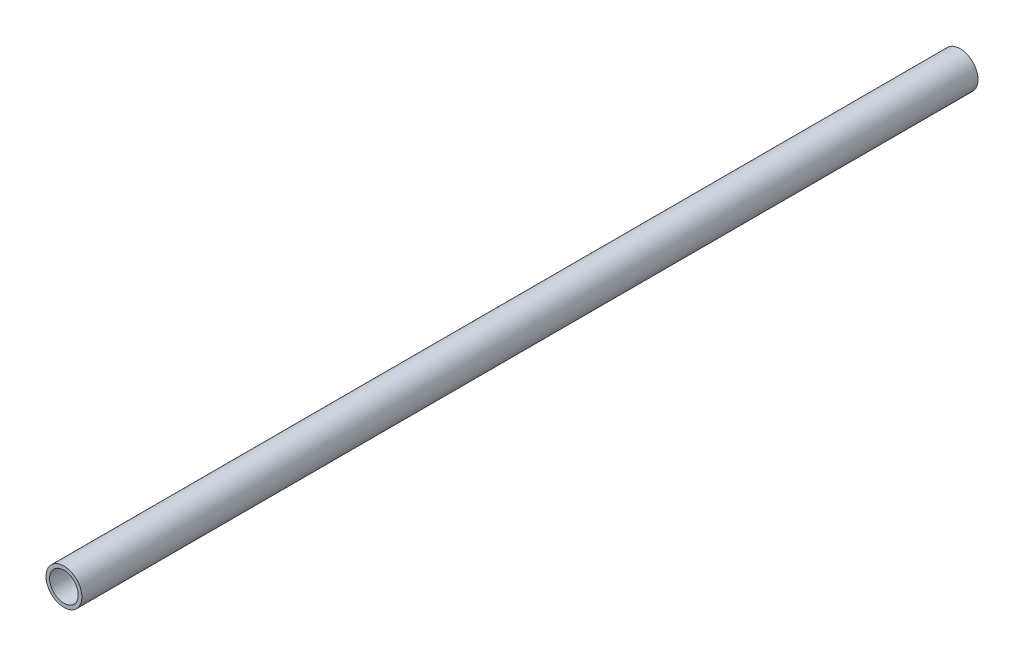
ISO-10303-21;
HEADER;
FILE_DESCRIPTION(('STEP AP214'),'2;1');
FILE_NAME('part.step','',(''),(''),'','','');
FILE_SCHEMA(('AUTOMOTIVE_DESIGN { 1 0 10303 214 1 1 1 1 }'));
ENDSEC;
DATA;
#1=APPLICATION_CONTEXT('core data for automotive mechanical design processes');
#2=APPLICATION_PROTOCOL_DEFINITION('international standard','automotive_design',2000,#1);
#3=PRODUCT_CONTEXT('',#1,'mechanical');
#4=PRODUCT('Part','Part','',(#3));
#5=PRODUCT_RELATED_PRODUCT_CATEGORY('part','',(#4));
#6=PRODUCT_DEFINITION_FORMATION('','',#4);
#7=PRODUCT_DEFINITION_CONTEXT('part definition',#1,'design');
#8=PRODUCT_DEFINITION('design','',#6,#7);
#9=PRODUCT_DEFINITION_SHAPE('','',#8);
#10=(LENGTH_UNIT() NAMED_UNIT(*) SI_UNIT(.MILLI.,.METRE.));
#11=(NAMED_UNIT(*) PLANE_ANGLE_UNIT() SI_UNIT($,.RADIAN.));
#12=(NAMED_UNIT(*) SI_UNIT($,.STERADIAN.) SOLID_ANGLE_UNIT());
#13=UNCERTAINTY_MEASURE_WITH_UNIT(LENGTH_MEASURE(1.E-05),#10,'distance_accuracy_value','');
#14=(GEOMETRIC_REPRESENTATION_CONTEXT(3) GLOBAL_UNCERTAINTY_ASSIGNED_CONTEXT((#13)) GLOBAL_UNIT_ASSIGNED_CONTEXT((#10,
#11,#12)) REPRESENTATION_CONTEXT('',''));
#15=CARTESIAN_POINT('',(0.,0.,0.));
#16=DIRECTION('',(0.,0.,1.));
#17=DIRECTION('',(1.,0.,0.));
#18=AXIS2_PLACEMENT_3D('',#15,#16,#17);
#19=CARTESIAN_POINT('',(0.,0.,635.));
#20=DIRECTION('',(0.,0.,1.));
#21=DIRECTION('',(1.,0.,0.));
#22=AXIS2_PLACEMENT_3D('',#19,#20,#21);
#23=PLANE('',#22);
#24=CARTESIAN_POINT('',(0.,0.,635.));
#25=DIRECTION('',(0.,0.,1.));
#26=DIRECTION('',(1.,0.,0.));
#27=AXIS2_PLACEMENT_3D('',#24,#25,#26);
#28=CIRCLE('',#27,12.7);
#29=CARTESIAN_POINT('',(-12.7,0.,635.));
#30=VERTEX_POINT('',#29);
#31=EDGE_CURVE('E10',#30,#30,#28,.T.);
#32=ORIENTED_EDGE('',*,*,#31,.T.);
#33=EDGE_LOOP('',(#32));
#34=FACE_BOUND('',#33,.T.);
#35=CARTESIAN_POINT('',(0.,0.,635.));
#36=DIRECTION('',(0.,0.,1.));
#37=DIRECTION('',(1.,0.,0.));
#38=AXIS2_PLACEMENT_3D('',#35,#36,#37);
#39=CIRCLE('',#38,10.16);
#40=CARTESIAN_POINT('',(-10.16,0.,635.));
#41=VERTEX_POINT('',#40);
#42=EDGE_CURVE('E41',#41,#41,#39,.T.);
#43=ORIENTED_EDGE('',*,*,#42,.F.);
#44=EDGE_LOOP('',(#43));
#45=FACE_BOUND('',#44,.T.);
#46=ADVANCED_FACE('F30',(#34,#45),#23,.T.);
#47=CARTESIAN_POINT('',(0.,0.,0.));
#48=DIRECTION('',(0.,0.,1.));
#49=DIRECTION('',(1.,0.,0.));
#50=AXIS2_PLACEMENT_3D('',#47,#48,#49);
#51=PLANE('',#50);
#52=CARTESIAN_POINT('',(0.,0.,0.));
#53=DIRECTION('',(0.,0.,1.));
#54=DIRECTION('',(1.,0.,0.));
#55=AXIS2_PLACEMENT_3D('',#52,#53,#54);
#56=CIRCLE('',#55,12.7);
#57=CARTESIAN_POINT('',(-12.7,0.,-1.11022302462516E-13));
#58=VERTEX_POINT('',#57);
#59=EDGE_CURVE('E37',#58,#58,#56,.T.);
#60=ORIENTED_EDGE('',*,*,#59,.F.);
#61=EDGE_LOOP('',(#60));
#62=FACE_BOUND('',#61,.T.);
#63=CARTESIAN_POINT('',(0.,0.,0.));
#64=DIRECTION('',(0.,0.,1.));
#65=DIRECTION('',(1.,0.,0.));
#66=AXIS2_PLACEMENT_3D('',#63,#64,#65);
#67=CIRCLE('',#66,10.16);
#68=CARTESIAN_POINT('',(-10.16,0.,-1.11022302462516E-13));
#69=VERTEX_POINT('',#68);
#70=EDGE_CURVE('E45',#69,#69,#67,.T.);
#71=ORIENTED_EDGE('',*,*,#70,.T.);
#72=EDGE_LOOP('',(#71));
#73=FACE_BOUND('',#72,.T.);
#74=ADVANCED_FACE('F51',(#62,#73),#51,.F.);
#75=CARTESIAN_POINT('',(0.,0.,635.));
#76=DIRECTION('',(0.,0.,-1.));
#77=DIRECTION('',(-1.,0.,0.));
#78=AXIS2_PLACEMENT_3D('',#75,#76,#77);
#79=CYLINDRICAL_SURFACE('',#78,12.7);
#80=CARTESIAN_POINT('',(-12.7,0.,635.));
#81=CARTESIAN_POINT('',(-12.7,0.,628.385416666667));
#82=CARTESIAN_POINT('',(-12.7,0.,621.770833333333));
#83=CARTESIAN_POINT('',(-12.7,0.,608.541666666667));
#84=CARTESIAN_POINT('',(-12.7,0.,601.927083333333));
#85=CARTESIAN_POINT('',(-12.7,0.,588.697916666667));
#86=CARTESIAN_POINT('',(-12.7,0.,582.083333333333));
#87=CARTESIAN_POINT('',(-12.7,0.,568.854166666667));
#88=CARTESIAN_POINT('',(-12.7,0.,562.239583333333));
#89=CARTESIAN_POINT('',(-12.7,0.,549.010416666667));
#90=CARTESIAN_POINT('',(-12.7,0.,542.395833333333));
#91=CARTESIAN_POINT('',(-12.7,0.,529.166666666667));
#92=CARTESIAN_POINT('',(-12.7,0.,522.552083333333));
#93=CARTESIAN_POINT('',(-12.7,0.,509.322916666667));
#94=CARTESIAN_POINT('',(-12.7,0.,502.708333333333));
#95=CARTESIAN_POINT('',(-12.7,0.,489.479166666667));
#96=CARTESIAN_POINT('',(-12.7,0.,482.864583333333));
#97=CARTESIAN_POINT('',(-12.7,0.,469.635416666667));
#98=CARTESIAN_POINT('',(-12.7,0.,463.020833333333));
#99=CARTESIAN_POINT('',(-12.7,0.,449.791666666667));
#100=CARTESIAN_POINT('',(-12.7,0.,443.177083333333));
#101=CARTESIAN_POINT('',(-12.7,0.,429.947916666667));
#102=CARTESIAN_POINT('',(-12.7,0.,423.333333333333));
#103=CARTESIAN_POINT('',(-12.7,0.,410.104166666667));
#104=CARTESIAN_POINT('',(-12.7,0.,403.489583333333));
#105=CARTESIAN_POINT('',(-12.7,0.,390.260416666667));
#106=CARTESIAN_POINT('',(-12.7,0.,383.645833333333));
#107=CARTESIAN_POINT('',(-12.7,0.,370.416666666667));
#108=CARTESIAN_POINT('',(-12.7,0.,363.802083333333));
#109=CARTESIAN_POINT('',(-12.7,0.,350.572916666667));
#110=CARTESIAN_POINT('',(-12.7,0.,343.958333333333));
#111=CARTESIAN_POINT('',(-12.7,0.,330.729166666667));
#112=CARTESIAN_POINT('',(-12.7,0.,324.114583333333));
#113=CARTESIAN_POINT('',(-12.7,0.,310.885416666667));
#114=CARTESIAN_POINT('',(-12.7,0.,304.270833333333));
#115=CARTESIAN_POINT('',(-12.7,0.,291.041666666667));
#116=CARTESIAN_POINT('',(-12.7,0.,284.427083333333));
#117=CARTESIAN_POINT('',(-12.7,0.,271.197916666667));
#118=CARTESIAN_POINT('',(-12.7,0.,264.583333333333));
#119=CARTESIAN_POINT('',(-12.7,0.,251.354166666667));
#120=CARTESIAN_POINT('',(-12.7,0.,244.739583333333));
#121=CARTESIAN_POINT('',(-12.7,0.,231.510416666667));
#122=CARTESIAN_POINT('',(-12.7,0.,224.895833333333));
#123=CARTESIAN_POINT('',(-12.7,0.,211.666666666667));
#124=CARTESIAN_POINT('',(-12.7,0.,205.052083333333));
#125=CARTESIAN_POINT('',(-12.7,0.,191.822916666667));
#126=CARTESIAN_POINT('',(-12.7,0.,185.208333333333));
#127=CARTESIAN_POINT('',(-12.7,0.,171.979166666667));
#128=CARTESIAN_POINT('',(-12.7,0.,165.364583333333));
#129=CARTESIAN_POINT('',(-12.7,0.,152.135416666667));
#130=CARTESIAN_POINT('',(-12.7,0.,145.520833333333));
#131=CARTESIAN_POINT('',(-12.7,0.,132.291666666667));
#132=CARTESIAN_POINT('',(-12.7,0.,125.677083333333));
#133=CARTESIAN_POINT('',(-12.7,0.,112.447916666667));
#134=CARTESIAN_POINT('',(-12.7,0.,105.833333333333));
#135=CARTESIAN_POINT('',(-12.7,0.,92.6041666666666));
#136=CARTESIAN_POINT('',(-12.7,0.,85.9895833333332));
#137=CARTESIAN_POINT('',(-12.7,0.,72.7604166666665));
#138=CARTESIAN_POINT('',(-12.7,0.,66.1458333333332));
#139=CARTESIAN_POINT('',(-12.7,0.,52.9166666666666));
#140=CARTESIAN_POINT('',(-12.7,0.,46.3020833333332));
#141=CARTESIAN_POINT('',(-12.7,0.,33.0729166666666));
#142=CARTESIAN_POINT('',(-12.7,0.,26.4583333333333));
#143=CARTESIAN_POINT('',(-12.7,0.,13.2291666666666));
#144=CARTESIAN_POINT('',(-12.7,0.,6.61458333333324));
#145=CARTESIAN_POINT('',(-12.7,0.,-1.11022302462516E-13));
#146=B_SPLINE_CURVE_WITH_KNOTS('',3,(#80,#81,#82,#83,#84,#85,#86,#87,#88,#89,#90,#91,#92,#93,
#94,#95,#96,#97,#98,#99,#100,#101,#102,#103,#104,#105,#106,#107,#108,#109,#110,#111,#112,#113,
#114,#115,#116,#117,#118,#119,#120,#121,#122,#123,#124,#125,#126,#127,#128,#129,#130,#131,#132,
#133,#134,#135,#136,#137,#138,#139,#140,#141,#142,#143,#144,#145),.UNSPECIFIED.,.F.,.F.,(4,2,2,
2,2,2,2,2,2,2,2,2,2,2,2,2,2,2,2,2,2,2,2,2,2,2,2,2,2,2,2,2,4),(0.,19.8437499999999,39.6875,
59.5312499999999,79.375,99.2187499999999,119.0625,138.90625,158.75,178.59375,198.4375,218.28125,
238.125,257.96875,277.8125,297.65625,317.5,337.34375,357.1875,377.03125,396.875,416.71875,
436.5625,456.40625,476.25,496.09375,515.9375,535.78125,555.625,575.46875,595.3125,615.15625,
635.),.UNSPECIFIED.);
#147=EDGE_CURVE('BSEAM32',#30,#58,#146,.T.);
#148=ORIENTED_EDGE('',*,*,#31,.F.);
#149=ORIENTED_EDGE('',*,*,#59,.T.);
#150=ORIENTED_EDGE('',*,*,#147,.T.);
#151=ORIENTED_EDGE('',*,*,#147,.F.);
#152=EDGE_LOOP('',(#148,#150,#149,#151));
#153=FACE_BOUND('',#152,.T.);
#154=ADVANCED_FACE('F32',(#153),#79,.T.);
#155=CARTESIAN_POINT('',(0.,0.,635.));
#156=DIRECTION('',(0.,0.,-1.));
#157=DIRECTION('',(-1.,0.,0.));
#158=AXIS2_PLACEMENT_3D('',#155,#156,#157);
#159=CYLINDRICAL_SURFACE('',#158,10.16);
#160=CARTESIAN_POINT('',(-10.16,0.,635.));
#161=CARTESIAN_POINT('',(-10.16,0.,628.385416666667));
#162=CARTESIAN_POINT('',(-10.16,0.,621.770833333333));
#163=CARTESIAN_POINT('',(-10.16,0.,608.541666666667));
#164=CARTESIAN_POINT('',(-10.16,0.,601.927083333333));
#165=CARTESIAN_POINT('',(-10.16,0.,588.697916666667));
#166=CARTESIAN_POINT('',(-10.16,0.,582.083333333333));
#167=CARTESIAN_POINT('',(-10.16,0.,568.854166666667));
#168=CARTESIAN_POINT('',(-10.16,0.,562.239583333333));
#169=CARTESIAN_POINT('',(-10.16,0.,549.010416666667));
#170=CARTESIAN_POINT('',(-10.16,0.,542.395833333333));
#171=CARTESIAN_POINT('',(-10.16,0.,529.166666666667));
#172=CARTESIAN_POINT('',(-10.16,0.,522.552083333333));
#173=CARTESIAN_POINT('',(-10.16,0.,509.322916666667));
#174=CARTESIAN_POINT('',(-10.16,0.,502.708333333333));
#175=CARTESIAN_POINT('',(-10.16,0.,489.479166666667));
#176=CARTESIAN_POINT('',(-10.16,0.,482.864583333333));
#177=CARTESIAN_POINT('',(-10.16,0.,469.635416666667));
#178=CARTESIAN_POINT('',(-10.16,0.,463.020833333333));
#179=CARTESIAN_POINT('',(-10.16,0.,449.791666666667));
#180=CARTESIAN_POINT('',(-10.16,0.,443.177083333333));
#181=CARTESIAN_POINT('',(-10.16,0.,429.947916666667));
#182=CARTESIAN_POINT('',(-10.16,0.,423.333333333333));
#183=CARTESIAN_POINT('',(-10.16,0.,410.104166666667));
#184=CARTESIAN_POINT('',(-10.16,0.,403.489583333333));
#185=CARTESIAN_POINT('',(-10.16,0.,390.260416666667));
#186=CARTESIAN_POINT('',(-10.16,0.,383.645833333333));
#187=CARTESIAN_POINT('',(-10.16,0.,370.416666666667));
#188=CARTESIAN_POINT('',(-10.16,0.,363.802083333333));
#189=CARTESIAN_POINT('',(-10.16,0.,350.572916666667));
#190=CARTESIAN_POINT('',(-10.16,0.,343.958333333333));
#191=CARTESIAN_POINT('',(-10.16,0.,330.729166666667));
#192=CARTESIAN_POINT('',(-10.16,0.,324.114583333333));
#193=CARTESIAN_POINT('',(-10.16,0.,310.885416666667));
#194=CARTESIAN_POINT('',(-10.16,0.,304.270833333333));
#195=CARTESIAN_POINT('',(-10.16,0.,291.041666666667));
#196=CARTESIAN_POINT('',(-10.16,0.,284.427083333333));
#197=CARTESIAN_POINT('',(-10.16,0.,271.197916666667));
#198=CARTESIAN_POINT('',(-10.16,0.,264.583333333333));
#199=CARTESIAN_POINT('',(-10.16,0.,251.354166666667));
#200=CARTESIAN_POINT('',(-10.16,0.,244.739583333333));
#201=CARTESIAN_POINT('',(-10.16,0.,231.510416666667));
#202=CARTESIAN_POINT('',(-10.16,0.,224.895833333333));
#203=CARTESIAN_POINT('',(-10.16,0.,211.666666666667));
#204=CARTESIAN_POINT('',(-10.16,0.,205.052083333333));
#205=CARTESIAN_POINT('',(-10.16,0.,191.822916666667));
#206=CARTESIAN_POINT('',(-10.16,0.,185.208333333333));
#207=CARTESIAN_POINT('',(-10.16,0.,171.979166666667));
#208=CARTESIAN_POINT('',(-10.16,0.,165.364583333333));
#209=CARTESIAN_POINT('',(-10.16,0.,152.135416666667));
#210=CARTESIAN_POINT('',(-10.16,0.,145.520833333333));
#211=CARTESIAN_POINT('',(-10.16,0.,132.291666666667));
#212=CARTESIAN_POINT('',(-10.16,0.,125.677083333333));
#213=CARTESIAN_POINT('',(-10.16,0.,112.447916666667));
#214=CARTESIAN_POINT('',(-10.16,0.,105.833333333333));
#215=CARTESIAN_POINT('',(-10.16,0.,92.6041666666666));
#216=CARTESIAN_POINT('',(-10.16,0.,85.9895833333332));
#217=CARTESIAN_POINT('',(-10.16,0.,72.7604166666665));
#218=CARTESIAN_POINT('',(-10.16,0.,66.1458333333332));
#219=CARTESIAN_POINT('',(-10.16,0.,52.9166666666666));
#220=CARTESIAN_POINT('',(-10.16,0.,46.3020833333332));
#221=CARTESIAN_POINT('',(-10.16,0.,33.0729166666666));
#222=CARTESIAN_POINT('',(-10.16,0.,26.4583333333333));
#223=CARTESIAN_POINT('',(-10.16,0.,13.2291666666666));
#224=CARTESIAN_POINT('',(-10.16,0.,6.61458333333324));
#225=CARTESIAN_POINT('',(-10.16,0.,-1.11022302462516E-13));
#226=B_SPLINE_CURVE_WITH_KNOTS('',3,(#160,#161,#162,#163,#164,#165,#166,#167,#168,#169,#170,
#171,#172,#173,#174,#175,#176,#177,#178,#179,#180,#181,#182,#183,#184,#185,#186,#187,#188,#189,
#190,#191,#192,#193,#194,#195,#196,#197,#198,#199,#200,#201,#202,#203,#204,#205,#206,#207,#208,
#209,#210,#211,#212,#213,#214,#215,#216,#217,#218,#219,#220,#221,#222,#223,#224,#225),
.UNSPECIFIED.,.F.,.F.,(4,2,2,2,2,2,2,2,2,2,2,2,2,2,2,2,2,2,2,2,2,2,2,2,2,2,2,2,2,2,2,2,4),(0.,
19.8437499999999,39.6875,59.5312499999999,79.375,99.2187499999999,119.0625,138.90625,158.75,
178.59375,198.4375,218.28125,238.125,257.96875,277.8125,297.65625,317.5,337.34375,357.1875,
377.03125,396.875,416.71875,436.5625,456.40625,476.25,496.09375,515.9375,535.78125,555.625,
575.46875,595.3125,615.15625,635.),.UNSPECIFIED.);
#227=EDGE_CURVE('BSEAM53',#41,#69,#226,.T.);
#228=ORIENTED_EDGE('',*,*,#42,.T.);
#229=ORIENTED_EDGE('',*,*,#70,.F.);
#230=ORIENTED_EDGE('',*,*,#227,.T.);
#231=ORIENTED_EDGE('',*,*,#227,.F.);
#232=EDGE_LOOP('',(#228,#230,#229,#231));
#233=FACE_BOUND('',#232,.T.);
#234=ADVANCED_FACE('F53',(#233),#159,.F.);
#235=CLOSED_SHELL('',(#46,#74,#154,#234));
#236=MANIFOLD_SOLID_BREP('B2',#235);
#237=ADVANCED_BREP_SHAPE_REPRESENTATION('',(#18,#236),#14);
#238=SHAPE_DEFINITION_REPRESENTATION(#9,#237);
ENDSEC;
END-ISO-10303-21;
